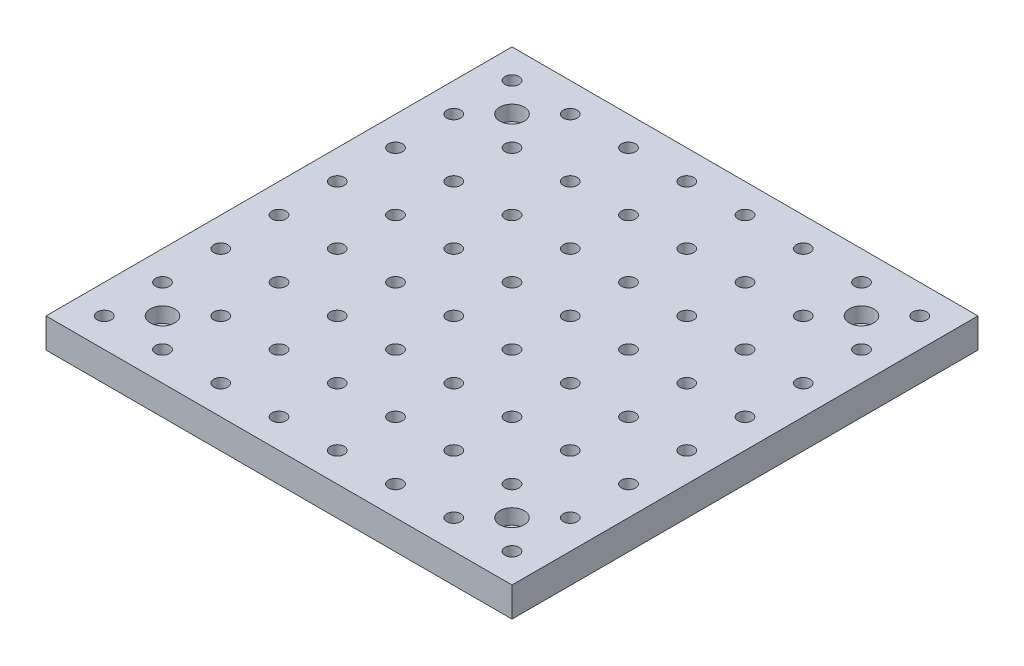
from build123d import *

# Parameters (mm, degrees)
SKETCH1_W                                  = 200
SKETCH1_H                                  = 200
SKETCH1_R                                  = 3
BOSS_EXTRUDE1_DEPTH                        = 12.7
SKETCH2_R                                  = 5.25
CUT_EXTRUDE1_DEPTH                         = 6.5
SKETCH3_R                                  = 1.65
CUT_EXTRUDE2_DEPTH                         = 142.570653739
MIRROR1_AT_THE_SECOND_PLANE_COPY_1_SKETC_R = 1.65
MIRROR1_AT_THE_SECOND_PLANE_COPY_1_DEPTH   = 142.570653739


with BuildPart() as part:
    # Sketch1 → Boss-Extrude1 (new body)
    with BuildSketch(Plane(origin=(0, 0, 0), x_dir=(1, 0, 0), z_dir=(0, 1, 0))):
        Rectangle(SKETCH1_W, SKETCH1_H)
        with Locations(Location((-87.5, 87.5, 0), (0, 0, 270))):
            Circle(SKETCH1_R, mode=Mode.SUBTRACT)
        with Locations(Location((-62.5, 87.5, 0), (0, 0, 270))):
            Circle(SKETCH1_R, mode=Mode.SUBTRACT)
        with Locations(Location((-37.5, 87.5, 0), (0, 0, 270))):
            Circle(SKETCH1_R, mode=Mode.SUBTRACT)
        with Locations(Location((-12.5, 87.5, 0), (0, 0, 270))):
            Circle(SKETCH1_R, mode=Mode.SUBTRACT)
        with Locations(Location((12.5, 87.5, 0), (0, 0, 270))):
            Circle(SKETCH1_R, mode=Mode.SUBTRACT)
        with Locations(Location((37.5, 87.5, 0), (0, 0, 270))):
            Circle(SKETCH1_R, mode=Mode.SUBTRACT)
        with Locations(Location((62.5, 87.5, 0), (0, 0, 270))):
            Circle(SKETCH1_R, mode=Mode.SUBTRACT)
        with Locations(Location((87.5, 87.5, 0), (0, 0, 270))):
            Circle(SKETCH1_R, mode=Mode.SUBTRACT)
        with Locations(Location((-62.5, 62.5, 0), (0, 0, 270))):
            Circle(SKETCH1_R, mode=Mode.SUBTRACT)
        with Locations(Location((-37.5, 62.5, 0), (0, 0, 270))):
            Circle(SKETCH1_R, mode=Mode.SUBTRACT)
        with Locations(Location((-12.5, 62.5, 0), (0, 0, 270))):
            Circle(SKETCH1_R, mode=Mode.SUBTRACT)
        with Locations(Location((12.5, 62.5, 0), (0, 0, 270))):
            Circle(SKETCH1_R, mode=Mode.SUBTRACT)
        with Locations(Location((37.5, 62.5, 0), (0, 0, 270))):
            Circle(SKETCH1_R, mode=Mode.SUBTRACT)
        with Locations(Location((62.5, 62.5, 0), (0, 0, 270))):
            Circle(SKETCH1_R, mode=Mode.SUBTRACT)
        with Locations(Location((87.5, 62.5, 0), (0, 0, 270))):
            Circle(SKETCH1_R, mode=Mode.SUBTRACT)
        with Locations(Location((-62.5, 37.5, 0), (0, 0, 270))):
            Circle(SKETCH1_R, mode=Mode.SUBTRACT)
        with Locations(Location((-37.5, 37.5, 0), (0, 0, 270))):
            Circle(SKETCH1_R, mode=Mode.SUBTRACT)
        with Locations(Location((-12.5, 37.5, 0), (0, 0, 270))):
            Circle(SKETCH1_R, mode=Mode.SUBTRACT)
        with Locations(Location((12.5, 37.5, 0), (0, 0, 270))):
            Circle(SKETCH1_R, mode=Mode.SUBTRACT)
        with Locations(Location((37.5, 37.5, 0), (0, 0, 270))):
            Circle(SKETCH1_R, mode=Mode.SUBTRACT)
        with Locations(Location((62.5, 37.5, 0), (0, 0, 270))):
            Circle(SKETCH1_R, mode=Mode.SUBTRACT)
        with Locations(Location((87.5, 37.5, 0), (0, 0, 270))):
            Circle(SKETCH1_R, mode=Mode.SUBTRACT)
        with Locations(Location((-62.5, 12.5, 0), (0, 0, 270))):
            Circle(SKETCH1_R, mode=Mode.SUBTRACT)
        with Locations(Location((-37.5, 12.5, 0), (0, 0, 270))):
            Circle(SKETCH1_R, mode=Mode.SUBTRACT)
        with Locations(Location((-12.5, 12.5, 0), (0, 0, 270))):
            Circle(SKETCH1_R, mode=Mode.SUBTRACT)
        with Locations(Location((12.5, 12.5, 0), (0, 0, 270))):
            Circle(SKETCH1_R, mode=Mode.SUBTRACT)
        with Locations(Location((37.5, 12.5, 0), (0, 0, 270))):
            Circle(SKETCH1_R, mode=Mode.SUBTRACT)
        with Locations(Location((62.5, 12.5, 0), (0, 0, 270))):
            Circle(SKETCH1_R, mode=Mode.SUBTRACT)
        with Locations(Location((87.5, 12.5, 0), (0, 0, 270))):
            Circle(SKETCH1_R, mode=Mode.SUBTRACT)
        with Locations(Location((-62.5, -12.5, 0), (0, 0, 270))):
            Circle(SKETCH1_R, mode=Mode.SUBTRACT)
        with Locations(Location((-37.5, -12.5, 0), (0, 0, 270))):
            Circle(SKETCH1_R, mode=Mode.SUBTRACT)
        with Locations(Location((-12.5, -12.5, 0), (0, 0, 270))):
            Circle(SKETCH1_R, mode=Mode.SUBTRACT)
        with Locations(Location((12.5, -12.5, 0), (0, 0, 270))):
            Circle(SKETCH1_R, mode=Mode.SUBTRACT)
        with Locations(Location((37.5, -12.5, 0), (0, 0, 270))):
            Circle(SKETCH1_R, mode=Mode.SUBTRACT)
        with Locations(Location((62.5, -12.5, 0), (0, 0, 270))):
            Circle(SKETCH1_R, mode=Mode.SUBTRACT)
        with Locations(Location((87.5, -12.5, 0), (0, 0, 270))):
            Circle(SKETCH1_R, mode=Mode.SUBTRACT)
        with Locations(Location((-62.5, -37.5, 0), (0, 0, 270))):
            Circle(SKETCH1_R, mode=Mode.SUBTRACT)
        with Locations(Location((-37.5, -37.5, 0), (0, 0, 270))):
            Circle(SKETCH1_R, mode=Mode.SUBTRACT)
        with Locations(Location((-12.5, -37.5, 0), (0, 0, 270))):
            Circle(SKETCH1_R, mode=Mode.SUBTRACT)
        with Locations(Location((12.5, -37.5, 0), (0, 0, 270))):
            Circle(SKETCH1_R, mode=Mode.SUBTRACT)
        with Locations(Location((37.5, -37.5, 0), (0, 0, 270))):
            Circle(SKETCH1_R, mode=Mode.SUBTRACT)
        with Locations(Location((62.5, -37.5, 0), (0, 0, 270))):
            Circle(SKETCH1_R, mode=Mode.SUBTRACT)
        with Locations(Location((87.5, -37.5, 0), (0, 0, 270))):
            Circle(SKETCH1_R, mode=Mode.SUBTRACT)
        with Locations(Location((-62.5, -62.5, 0), (0, 0, 270))):
            Circle(SKETCH1_R, mode=Mode.SUBTRACT)
        with Locations(Location((-37.5, -62.5, 0), (0, 0, 270))):
            Circle(SKETCH1_R, mode=Mode.SUBTRACT)
        with Locations(Location((-12.5, -62.5, 0), (0, 0, 270))):
            Circle(SKETCH1_R, mode=Mode.SUBTRACT)
        with Locations(Location((12.5, -62.5, 0), (0, 0, 270))):
            Circle(SKETCH1_R, mode=Mode.SUBTRACT)
        with Locations(Location((37.5, -62.5, 0), (0, 0, 270))):
            Circle(SKETCH1_R, mode=Mode.SUBTRACT)
        with Locations(Location((62.5, -62.5, 0), (0, 0, 270))):
            Circle(SKETCH1_R, mode=Mode.SUBTRACT)
        with Locations(Location((87.5, -62.5, 0), (0, 0, 270))):
            Circle(SKETCH1_R, mode=Mode.SUBTRACT)
        with Locations(Location((-62.5, -87.5, 0), (0, 0, 270))):
            Circle(SKETCH1_R, mode=Mode.SUBTRACT)
        with Locations(Location((-37.5, -87.5, 0), (0, 0, 270))):
            Circle(SKETCH1_R, mode=Mode.SUBTRACT)
        with Locations(Location((-12.5, -87.5, 0), (0, 0, 270))):
            Circle(SKETCH1_R, mode=Mode.SUBTRACT)
        with Locations(Location((12.5, -87.5, 0), (0, 0, 270))):
            Circle(SKETCH1_R, mode=Mode.SUBTRACT)
        with Locations(Location((37.5, -87.5, 0), (0, 0, 270))):
            Circle(SKETCH1_R, mode=Mode.SUBTRACT)
        with Locations(Location((62.5, -87.5, 0), (0, 0, 270))):
            Circle(SKETCH1_R, mode=Mode.SUBTRACT)
        with Locations(Location((87.5, -87.5, 0), (0, 0, 270))):
            Circle(SKETCH1_R, mode=Mode.SUBTRACT)
        with Locations(Location((-87.5, 62.5, 0), (0, 0, 270))):
            Circle(SKETCH1_R, mode=Mode.SUBTRACT)
        with Locations(Location((-87.5, 37.5, 0), (0, 0, 270))):
            Circle(SKETCH1_R, mode=Mode.SUBTRACT)
        with Locations(Location((-87.5, 12.5, 0), (0, 0, 270))):
            Circle(SKETCH1_R, mode=Mode.SUBTRACT)
        with Locations(Location((-87.5, -12.5, 0), (0, 0, 270))):
            Circle(SKETCH1_R, mode=Mode.SUBTRACT)
        with Locations(Location((-87.5, -37.5, 0), (0, 0, 270))):
            Circle(SKETCH1_R, mode=Mode.SUBTRACT)
        with Locations(Location((-87.5, -62.5, 0), (0, 0, 270))):
            Circle(SKETCH1_R, mode=Mode.SUBTRACT)
        with Locations(Location((-87.5, -87.5, 0), (0, 0, 270))):
            Circle(SKETCH1_R, mode=Mode.SUBTRACT)
    extrude(amount=-BOSS_EXTRUDE1_DEPTH)

    # Sketch2 → Cut-Extrude1 (cut)
    with BuildSketch(Plane(origin=(0, 0, 0), x_dir=(1, 0, 0), z_dir=(0, 1, 0))):
        with Locations(Location((-75, -75, 0), (0, 0, 270))):
            Circle(SKETCH2_R)
        with Locations(Location((75, -75, 0), (0, 0, 270))):
            Circle(SKETCH2_R)
        with Locations(Location((75, 75, 0), (0, 0, 270))):
            Circle(SKETCH2_R)
        with Locations(Location((-75, 75, 0), (0, 0, 270))):
            Circle(SKETCH2_R)
    extrude(amount=-CUT_EXTRUDE1_DEPTH, mode=Mode.SUBTRACT)

    # Sketch3 → Cut-Extrude2 (cut, symmetric)
    with BuildSketch(Plane(origin=(0, -6.5, 0), x_dir=(1, 0, 0), z_dir=(0, 1, 0))):
        with Locations(Location((-75, -75, 0), (0, 0, 270))):
            Circle(SKETCH3_R)
    cut_extrude2 = extrude(amount=CUT_EXTRUDE2_DEPTH, both=True, mode=Mode.SUBTRACT)

    # Mirror1: Cut-Extrude2 across plane
    add(cut_extrude2.mirror(Plane(origin=(0, 0, 0), x_dir=(0, 0, 1), z_dir=(1, 0, 0))), mode=Mode.SUBTRACT)

    # Mirror1 at the second plane: Cut-Extrude2 across plane
    add(cut_extrude2.mirror(Plane.XY), mode=Mode.SUBTRACT)

    # Mirror1 at the second plane copy 1 sketc → Mirror1 at the second plane copy 1 (cut, symmetric)
    with BuildSketch(Plane(origin=(0, -6.5, 0), x_dir=(-1, 0, 0), z_dir=(0, 1, 0))):
        with Locations(Location((-75, -75, 0), (0, 0, 270))):
            Circle(MIRROR1_AT_THE_SECOND_PLANE_COPY_1_SKETC_R)
    extrude(amount=MIRROR1_AT_THE_SECOND_PLANE_COPY_1_DEPTH, both=True, mode=Mode.SUBTRACT)


solid = part.part
